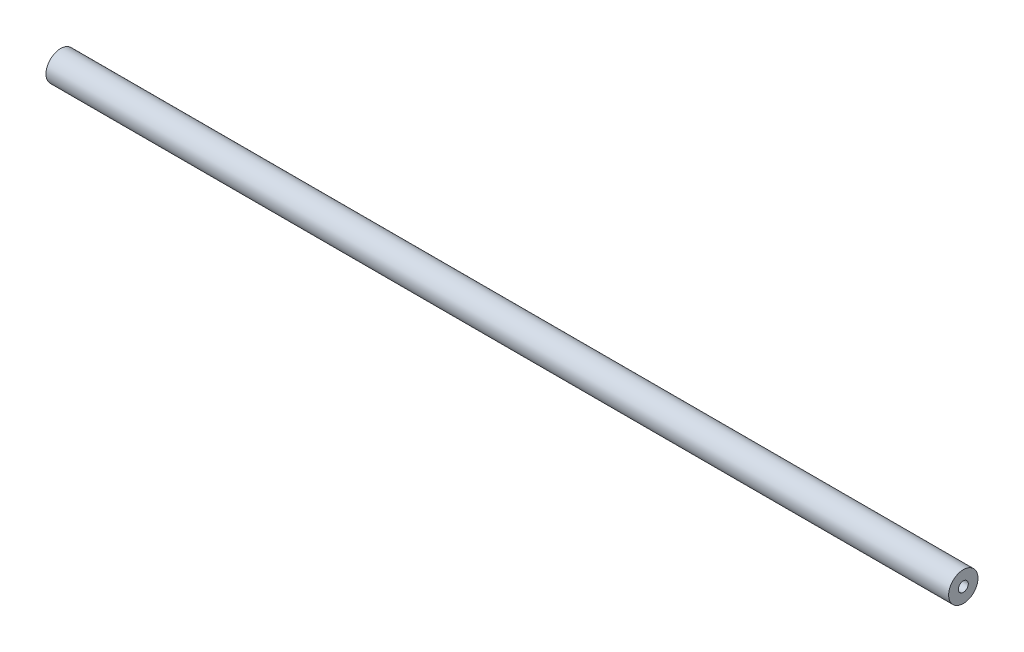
ISO-10303-21;
HEADER;
FILE_DESCRIPTION(('STEP AP214'),'2;1');
FILE_NAME('part.step','',(''),(''),'','','');
FILE_SCHEMA(('AUTOMOTIVE_DESIGN { 1 0 10303 214 1 1 1 1 }'));
ENDSEC;
DATA;
#1=APPLICATION_CONTEXT('core data for automotive mechanical design processes');
#2=APPLICATION_PROTOCOL_DEFINITION('international standard','automotive_design',2000,#1);
#3=PRODUCT_CONTEXT('',#1,'mechanical');
#4=PRODUCT('Part','Part','',(#3));
#5=PRODUCT_RELATED_PRODUCT_CATEGORY('part','',(#4));
#6=PRODUCT_DEFINITION_FORMATION('','',#4);
#7=PRODUCT_DEFINITION_CONTEXT('part definition',#1,'design');
#8=PRODUCT_DEFINITION('design','',#6,#7);
#9=PRODUCT_DEFINITION_SHAPE('','',#8);
#10=(LENGTH_UNIT() NAMED_UNIT(*) SI_UNIT(.MILLI.,.METRE.));
#11=(NAMED_UNIT(*) PLANE_ANGLE_UNIT() SI_UNIT($,.RADIAN.));
#12=(NAMED_UNIT(*) SI_UNIT($,.STERADIAN.) SOLID_ANGLE_UNIT());
#13=UNCERTAINTY_MEASURE_WITH_UNIT(LENGTH_MEASURE(1.E-05),#10,'distance_accuracy_value','');
#14=(GEOMETRIC_REPRESENTATION_CONTEXT(3) GLOBAL_UNCERTAINTY_ASSIGNED_CONTEXT((#13)) GLOBAL_UNIT_ASSIGNED_CONTEXT((#10,
#11,#12)) REPRESENTATION_CONTEXT('',''));
#15=CARTESIAN_POINT('',(0.,0.,0.));
#16=DIRECTION('',(0.,0.,1.));
#17=DIRECTION('',(1.,0.,0.));
#18=AXIS2_PLACEMENT_3D('',#15,#16,#17);
#19=CARTESIAN_POINT('',(307.5,0.,-1.66533453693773E-13));
#20=DIRECTION('',(-1.,0.,0.));
#21=DIRECTION('',(0.,0.,1.00000000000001));
#22=AXIS2_PLACEMENT_3D('',#19,#20,#21);
#23=CYLINDRICAL_SURFACE('',#22,10.);
#24=CARTESIAN_POINT('',(307.5,0.,-1.66533453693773E-13));
#25=DIRECTION('',(1.,0.,0.));
#26=DIRECTION('',(0.,0.,-1.00000000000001));
#27=AXIS2_PLACEMENT_3D('',#24,#25,#26);
#28=CIRCLE('',#27,10.);
#29=CARTESIAN_POINT('',(307.5,0.,-10.0000000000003));
#30=VERTEX_POINT('',#29);
#31=EDGE_CURVE('E11',#30,#30,#28,.T.);
#32=ORIENTED_EDGE('',*,*,#31,.F.);
#33=EDGE_LOOP('',(#32));
#34=FACE_BOUND('',#33,.T.);
#35=CARTESIAN_POINT('',(-307.500000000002,-1.66533453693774E-13,0.));
#36=DIRECTION('',(1.,0.,0.));
#37=DIRECTION('',(0.,0.,-1.00000000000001));
#38=AXIS2_PLACEMENT_3D('',#35,#36,#37);
#39=CIRCLE('',#38,10.);
#40=CARTESIAN_POINT('',(-307.500000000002,-1.66533453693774E-13,-10.0000000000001));
#41=VERTEX_POINT('',#40);
#42=EDGE_CURVE('E52',#41,#41,#39,.T.);
#43=ORIENTED_EDGE('',*,*,#42,.T.);
#44=EDGE_LOOP('',(#43));
#45=FACE_BOUND('',#44,.T.);
#46=ADVANCED_FACE('F44',(#34,#45),#23,.T.);
#47=CARTESIAN_POINT('',(307.5,0.,-1.66533453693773E-13));
#48=DIRECTION('',(1.,0.,0.));
#49=DIRECTION('',(0.,0.,-1.00000000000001));
#50=AXIS2_PLACEMENT_3D('',#47,#48,#49);
#51=PLANE('',#50);
#52=CARTESIAN_POINT('',(307.5,0.,-1.66533453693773E-13));
#53=DIRECTION('',(1.,0.,0.));
#54=DIRECTION('',(0.,0.,-1.00000000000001));
#55=AXIS2_PLACEMENT_3D('',#52,#53,#54);
#56=CIRCLE('',#55,3.39999999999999);
#57=CARTESIAN_POINT('',(307.5,0.,-3.4000000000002));
#58=VERTEX_POINT('',#57);
#59=EDGE_CURVE('E78',#58,#58,#56,.T.);
#60=ORIENTED_EDGE('',*,*,#59,.F.);
#61=EDGE_LOOP('',(#60));
#62=FACE_BOUND('',#61,.T.);
#63=ORIENTED_EDGE('',*,*,#31,.T.);
#64=EDGE_LOOP('',(#63));
#65=FACE_BOUND('',#64,.T.);
#66=ADVANCED_FACE('F89',(#62,#65),#51,.T.);
#67=CARTESIAN_POINT('',(-307.500000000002,-1.66533453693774E-13,0.));
#68=DIRECTION('',(1.,0.,0.));
#69=DIRECTION('',(0.,0.,-1.00000000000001));
#70=AXIS2_PLACEMENT_3D('',#67,#68,#69);
#71=PLANE('',#70);
#72=CARTESIAN_POINT('',(-307.500000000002,-1.66533453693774E-13,0.));
#73=DIRECTION('',(-1.,0.,0.));
#74=DIRECTION('',(0.,0.,1.00000000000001));
#75=AXIS2_PLACEMENT_3D('',#72,#73,#74);
#76=CIRCLE('',#75,3.39999999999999);
#77=CARTESIAN_POINT('',(-307.500000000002,-1.66533453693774E-13,3.40000000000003));
#78=VERTEX_POINT('',#77);
#79=EDGE_CURVE('E68',#78,#78,#76,.T.);
#80=ORIENTED_EDGE('',*,*,#79,.F.);
#81=EDGE_LOOP('',(#80));
#82=FACE_BOUND('',#81,.T.);
#83=ORIENTED_EDGE('',*,*,#42,.F.);
#84=EDGE_LOOP('',(#83));
#85=FACE_BOUND('',#84,.T.);
#86=ADVANCED_FACE('F86',(#82,#85),#71,.F.);
#87=CARTESIAN_POINT('',(307.5,0.,-1.66533453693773E-13));
#88=DIRECTION('',(1.,0.,0.));
#89=DIRECTION('',(0.,0.,-1.00000000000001));
#90=AXIS2_PLACEMENT_3D('',#87,#88,#89);
#91=CYLINDRICAL_SURFACE('',#90,3.39999999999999);
#92=CARTESIAN_POINT('',(287.5,0.,-1.66533453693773E-13));
#93=DIRECTION('',(1.,0.,0.));
#94=DIRECTION('',(0.,0.,-1.00000000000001));
#95=AXIS2_PLACEMENT_3D('',#92,#93,#94);
#96=CIRCLE('',#95,3.39999999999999);
#97=CARTESIAN_POINT('',(287.5,0.,-3.40000000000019));
#98=VERTEX_POINT('',#97);
#99=EDGE_CURVE('E72',#98,#98,#96,.T.);
#100=ORIENTED_EDGE('',*,*,#99,.F.);
#101=EDGE_LOOP('',(#100));
#102=FACE_BOUND('',#101,.T.);
#103=ORIENTED_EDGE('',*,*,#59,.T.);
#104=EDGE_LOOP('',(#103));
#105=FACE_BOUND('',#104,.T.);
#106=ADVANCED_FACE('F88',(#102,#105),#91,.F.);
#107=CARTESIAN_POINT('',(287.5,0.,-1.66533453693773E-13));
#108=DIRECTION('',(1.,0.,0.));
#109=DIRECTION('',(0.,0.,-1.00000000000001));
#110=AXIS2_PLACEMENT_3D('',#107,#108,#109);
#111=CONICAL_SURFACE('',#110,3.39999999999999,1.02974425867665);
#112=CARTESIAN_POINT('',(285.457073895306,0.,-1.66533453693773E-13));
#113=VERTEX_POINT('',#112);
#114=VERTEX_LOOP('',#113);
#115=FACE_BOUND('',#114,.T.);
#116=ORIENTED_EDGE('',*,*,#99,.T.);
#117=EDGE_LOOP('',(#116));
#118=FACE_BOUND('',#117,.T.);
#119=ADVANCED_FACE('F96',(#115,#118),#111,.F.);
#120=CARTESIAN_POINT('',(-307.500000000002,-1.66533453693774E-13,0.));
#121=DIRECTION('',(-1.,0.,0.));
#122=DIRECTION('',(0.,0.,1.00000000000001));
#123=AXIS2_PLACEMENT_3D('',#120,#121,#122);
#124=CYLINDRICAL_SURFACE('',#123,3.39999999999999);
#125=CARTESIAN_POINT('',(-287.500000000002,0.,1.11022302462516E-13));
#126=DIRECTION('',(-1.,0.,0.));
#127=DIRECTION('',(0.,0.,1.00000000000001));
#128=AXIS2_PLACEMENT_3D('',#125,#126,#127);
#129=CIRCLE('',#128,3.39999999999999);
#130=CARTESIAN_POINT('',(-287.500000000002,0.,3.40000000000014));
#131=VERTEX_POINT('',#130);
#132=EDGE_CURVE('E65',#131,#131,#129,.T.);
#133=ORIENTED_EDGE('',*,*,#132,.F.);
#134=EDGE_LOOP('',(#133));
#135=FACE_BOUND('',#134,.T.);
#136=ORIENTED_EDGE('',*,*,#79,.T.);
#137=EDGE_LOOP('',(#136));
#138=FACE_BOUND('',#137,.T.);
#139=ADVANCED_FACE('F61',(#135,#138),#124,.F.);
#140=CARTESIAN_POINT('',(-287.500000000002,0.,1.11022302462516E-13));
#141=DIRECTION('',(-1.,0.,0.));
#142=DIRECTION('',(0.,0.,1.00000000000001));
#143=AXIS2_PLACEMENT_3D('',#140,#141,#142);
#144=CONICAL_SURFACE('',#143,3.39999999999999,1.02974425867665);
#145=CARTESIAN_POINT('',(-285.457073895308,0.,1.11022302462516E-13));
#146=VERTEX_POINT('',#145);
#147=VERTEX_LOOP('',#146);
#148=FACE_BOUND('',#147,.T.);
#149=ORIENTED_EDGE('',*,*,#132,.T.);
#150=EDGE_LOOP('',(#149));
#151=FACE_BOUND('',#150,.T.);
#152=ADVANCED_FACE('F58',(#148,#151),#144,.F.);
#153=CLOSED_SHELL('',(#46,#66,#86,#106,#119,#139,#152));
#154=MANIFOLD_SOLID_BREP('B2',#153);
#155=ADVANCED_BREP_SHAPE_REPRESENTATION('',(#18,#154),#14);
#156=SHAPE_DEFINITION_REPRESENTATION(#9,#155);
ENDSEC;
END-ISO-10303-21;
